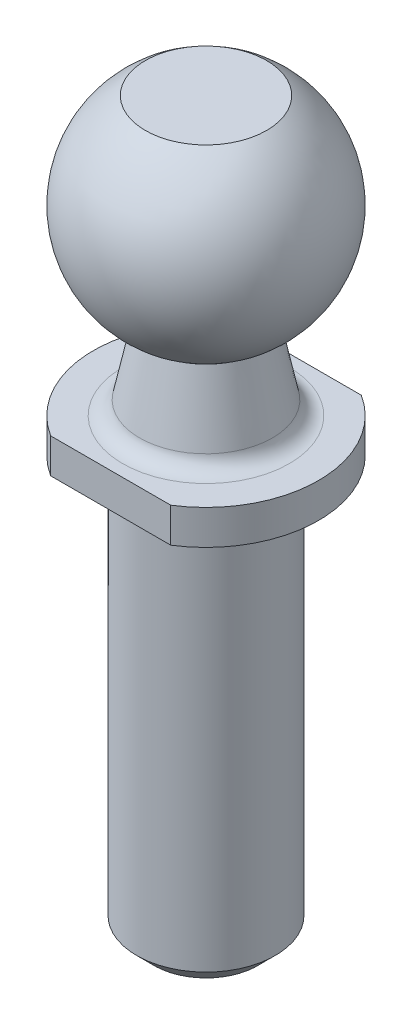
ISO-10303-21;
HEADER;
FILE_DESCRIPTION(('STEP AP214'),'2;1');
FILE_NAME('part.step','',(''),(''),'','','');
FILE_SCHEMA(('AUTOMOTIVE_DESIGN { 1 0 10303 214 1 1 1 1 }'));
ENDSEC;
DATA;
#1=APPLICATION_CONTEXT('core data for automotive mechanical design processes');
#2=APPLICATION_PROTOCOL_DEFINITION('international standard','automotive_design',2000,#1);
#3=PRODUCT_CONTEXT('',#1,'mechanical');
#4=PRODUCT('Part','Part','',(#3));
#5=PRODUCT_RELATED_PRODUCT_CATEGORY('part','',(#4));
#6=PRODUCT_DEFINITION_FORMATION('','',#4);
#7=PRODUCT_DEFINITION_CONTEXT('part definition',#1,'design');
#8=PRODUCT_DEFINITION('design','',#6,#7);
#9=PRODUCT_DEFINITION_SHAPE('','',#8);
#10=(LENGTH_UNIT() NAMED_UNIT(*) SI_UNIT(.MILLI.,.METRE.));
#11=(NAMED_UNIT(*) PLANE_ANGLE_UNIT() SI_UNIT($,.RADIAN.));
#12=(NAMED_UNIT(*) SI_UNIT($,.STERADIAN.) SOLID_ANGLE_UNIT());
#13=UNCERTAINTY_MEASURE_WITH_UNIT(LENGTH_MEASURE(1.E-05),#10,'distance_accuracy_value','');
#14=(GEOMETRIC_REPRESENTATION_CONTEXT(3) GLOBAL_UNCERTAINTY_ASSIGNED_CONTEXT((#13)) GLOBAL_UNIT_ASSIGNED_CONTEXT((#10,
#11,#12)) REPRESENTATION_CONTEXT('',''));
#15=CARTESIAN_POINT('',(0.,0.,0.));
#16=DIRECTION('',(0.,0.,1.));
#17=DIRECTION('',(1.,0.,0.));
#18=AXIS2_PLACEMENT_3D('',#15,#16,#17);
#19=CARTESIAN_POINT('',(-1.38777878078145E-13,12.5227744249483,1.38777878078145E-13));
#20=DIRECTION('',(0.,1.,0.));
#21=DIRECTION('',(-1.,0.,0.));
#22=AXIS2_PLACEMENT_3D('',#19,#20,#21);
#23=CYLINDRICAL_SURFACE('',#22,6.49999999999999);
#24=DIRECTION('',(0.,1.,0.));
#25=VECTOR('',#24,1.);
#26=CARTESIAN_POINT('',(3.46410161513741,12.5227744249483,5.50000000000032));
#27=LINE('',#26,#25);
#28=CARTESIAN_POINT('',(3.46410161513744,0.,5.50000000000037));
#29=VERTEX_POINT('',#28);
#30=CARTESIAN_POINT('',(3.46410161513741,1.99999999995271,5.50000000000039));
#31=VERTEX_POINT('',#30);
#32=EDGE_CURVE('E113',#29,#31,#27,.T.);
#33=ORIENTED_EDGE('',*,*,#32,.F.);
#34=CARTESIAN_POINT('',(0.,0.,0.));
#35=DIRECTION('',(0.,1.,0.));
#36=DIRECTION('',(-1.,0.,0.));
#37=AXIS2_PLACEMENT_3D('',#34,#35,#36);
#38=CIRCLE('',#37,6.49999999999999);
#39=CARTESIAN_POINT('',(3.46410161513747,0.,-5.49999999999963));
#40=VERTEX_POINT('',#39);
#41=EDGE_CURVE('E84',#29,#40,#38,.T.);
#42=ORIENTED_EDGE('',*,*,#41,.T.);
#43=DIRECTION('',(0.,1.,0.));
#44=VECTOR('',#43,1.);
#45=CARTESIAN_POINT('',(3.46410161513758,12.5227744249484,-5.49999999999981));
#46=LINE('',#45,#44);
#47=CARTESIAN_POINT('',(3.46410161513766,1.99999999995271,-5.49999999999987));
#48=VERTEX_POINT('',#47);
#49=EDGE_CURVE('E45',#48,#40,#46,.F.);
#50=ORIENTED_EDGE('',*,*,#49,.F.);
#51=CARTESIAN_POINT('',(0.,2.,0.));
#52=DIRECTION('',(0.,1.,0.));
#53=DIRECTION('',(-1.,0.,0.));
#54=AXIS2_PLACEMENT_3D('',#51,#52,#53);
#55=CIRCLE('',#54,6.49999999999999);
#56=EDGE_CURVE('E82',#31,#48,#55,.T.);
#57=ORIENTED_EDGE('',*,*,#56,.F.);
#58=EDGE_LOOP('',(#33,#42,#50,#57));
#59=FACE_BOUND('',#58,.T.);
#60=ADVANCED_FACE('F31',(#59),#23,.T.);
#61=DIRECTION('',(0.,1.,0.));
#62=VECTOR('',#61,1.);
#63=CARTESIAN_POINT('',(-3.46410161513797,12.5227744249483,5.50000000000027));
#64=LINE('',#63,#62);
#65=CARTESIAN_POINT('',(-3.46410161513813,1.99999999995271,5.50000000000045));
#66=VERTEX_POINT('',#65);
#67=CARTESIAN_POINT('',(-3.46410161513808,0.,5.50000000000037));
#68=VERTEX_POINT('',#67);
#69=EDGE_CURVE('E52',#66,#68,#64,.F.);
#70=ORIENTED_EDGE('',*,*,#69,.F.);
#71=CARTESIAN_POINT('',(-3.46410161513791,1.99999999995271,-5.49999999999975));
#72=VERTEX_POINT('',#71);
#73=EDGE_CURVE('E89',#72,#66,#55,.T.);
#74=ORIENTED_EDGE('',*,*,#73,.F.);
#75=DIRECTION('',(0.,1.,0.));
#76=VECTOR('',#75,1.);
#77=CARTESIAN_POINT('',(-3.46410161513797,12.5227744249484,-5.4999999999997));
#78=LINE('',#77,#76);
#79=CARTESIAN_POINT('',(-3.46410161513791,0.,-5.49999999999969));
#80=VERTEX_POINT('',#79);
#81=EDGE_CURVE('E71',#80,#72,#78,.T.);
#82=ORIENTED_EDGE('',*,*,#81,.F.);
#83=EDGE_CURVE('E110',#80,#68,#38,.T.);
#84=ORIENTED_EDGE('',*,*,#83,.T.);
#85=EDGE_LOOP('',(#70,#74,#82,#84));
#86=FACE_BOUND('',#85,.T.);
#87=ADVANCED_FACE('F109',(#86),#23,.T.);
#88=CARTESIAN_POINT('',(6.4999999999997,2.,3.60822483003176E-13));
#89=DIRECTION('',(0.,-1.,0.));
#90=DIRECTION('',(1.,0.,0.));
#91=AXIS2_PLACEMENT_3D('',#88,#89,#90);
#92=PLANE('',#91);
#93=CARTESIAN_POINT('',(0.,2.,0.));
#94=DIRECTION('',(0.,-1.,0.));
#95=DIRECTION('',(1.,0.,0.));
#96=AXIS2_PLACEMENT_3D('',#93,#94,#95);
#97=CIRCLE('',#96,4.81162232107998);
#98=CARTESIAN_POINT('',(4.81162232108,2.,0.));
#99=VERTEX_POINT('',#98);
#100=EDGE_CURVE('E92',#99,#99,#97,.T.);
#101=ORIENTED_EDGE('',*,*,#100,.T.);
#102=EDGE_LOOP('',(#101));
#103=FACE_BOUND('',#102,.T.);
#104=DIRECTION('',(1.,0.,0.));
#105=VECTOR('',#104,1.);
#106=CARTESIAN_POINT('',(7.07631874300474,1.9999999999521,5.50000000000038));
#107=LINE('',#106,#105);
#108=EDGE_CURVE('E76',#66,#31,#107,.T.);
#109=ORIENTED_EDGE('',*,*,#108,.T.);
#110=ORIENTED_EDGE('',*,*,#56,.T.);
#111=DIRECTION('',(-1.,0.,0.));
#112=VECTOR('',#111,1.);
#113=CARTESIAN_POINT('',(7.07631874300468,1.99999999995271,-5.49999999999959));
#114=LINE('',#113,#112);
#115=EDGE_CURVE('E68',#48,#72,#114,.T.);
#116=ORIENTED_EDGE('',*,*,#115,.T.);
#117=ORIENTED_EDGE('',*,*,#73,.T.);
#118=EDGE_LOOP('',(#109,#110,#116,#117));
#119=FACE_BOUND('',#118,.T.);
#120=ADVANCED_FACE('F87',(#103,#119),#92,.F.);
#121=CARTESIAN_POINT('',(3.99999999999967,0.,2.22044604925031E-13));
#122=DIRECTION('',(0.,1.,0.));
#123=DIRECTION('',(-1.,0.,0.));
#124=AXIS2_PLACEMENT_3D('',#121,#122,#123);
#125=PLANE('',#124);
#126=CARTESIAN_POINT('',(0.,0.,0.));
#127=DIRECTION('',(0.,1.,0.));
#128=DIRECTION('',(-1.,0.,0.));
#129=AXIS2_PLACEMENT_3D('',#126,#127,#128);
#130=CIRCLE('',#129,4.);
#131=CARTESIAN_POINT('',(-4.00000000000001,0.,0.));
#132=VERTEX_POINT('',#131);
#133=EDGE_CURVE('E115',#132,#132,#130,.T.);
#134=ORIENTED_EDGE('',*,*,#133,.T.);
#135=EDGE_LOOP('',(#134));
#136=FACE_BOUND('',#135,.T.);
#137=DIRECTION('',(1.,0.,0.));
#138=VECTOR('',#137,1.);
#139=CARTESIAN_POINT('',(3.99999999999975,0.,5.50000000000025));
#140=LINE('',#139,#138);
#141=EDGE_CURVE('E11',#68,#29,#140,.T.);
#142=ORIENTED_EDGE('',*,*,#141,.F.);
#143=ORIENTED_EDGE('',*,*,#83,.F.);
#144=DIRECTION('',(-1.,0.,0.));
#145=VECTOR('',#144,1.);
#146=CARTESIAN_POINT('',(3.99999999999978,0.,-5.49999999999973));
#147=LINE('',#146,#145);
#148=EDGE_CURVE('E38',#40,#80,#147,.T.);
#149=ORIENTED_EDGE('',*,*,#148,.F.);
#150=ORIENTED_EDGE('',*,*,#41,.F.);
#151=EDGE_LOOP('',(#142,#143,#149,#150));
#152=FACE_BOUND('',#151,.T.);
#153=ADVANCED_FACE('F112',(#136,#152),#125,.F.);
#154=CARTESIAN_POINT('',(0.,2.,0.));
#155=DIRECTION('',(0.,-1.,0.));
#156=DIRECTION('',(1.,0.,0.));
#157=AXIS2_PLACEMENT_3D('',#154,#155,#156);
#158=CONICAL_SURFACE('',#157,4.,0.207221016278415);
#159=CARTESIAN_POINT('',(0.,2.79425883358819,0.));
#160=DIRECTION('',(0.,-1.,0.));
#161=DIRECTION('',(1.,0.,0.));
#162=AXIS2_PLACEMENT_3D('',#159,#160,#161);
#163=CIRCLE('',#162,3.83301587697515);
#164=CARTESIAN_POINT('',(3.83301587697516,2.79425883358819,0.));
#165=VERTEX_POINT('',#164);
#166=EDGE_CURVE('E88',#165,#165,#163,.F.);
#167=ORIENTED_EDGE('',*,*,#166,.T.);
#168=EDGE_LOOP('',(#167));
#169=FACE_BOUND('',#168,.T.);
#170=CARTESIAN_POINT('',(-5.27355936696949E-13,6.75649312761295,-1.11022302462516E-13));
#171=DIRECTION('',(0.,1.,0.));
#172=DIRECTION('',(-1.,0.,0.));
#173=AXIS2_PLACEMENT_3D('',#170,#171,#172);
#174=CIRCLE('',#173,2.99999999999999);
#175=CARTESIAN_POINT('',(2.99999999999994,6.75649312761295,1.38777878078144E-13));
#176=VERTEX_POINT('',#175);
#177=EDGE_CURVE('E94',#176,#176,#174,.T.);
#178=ORIENTED_EDGE('',*,*,#177,.F.);
#179=EDGE_LOOP('',(#178));
#180=FACE_BOUND('',#179,.T.);
#181=ADVANCED_FACE('F129',(#169,#180),#158,.T.);
#182=CARTESIAN_POINT('',(-1.38777878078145E-13,12.5227744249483,1.38777878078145E-13));
#183=DIRECTION('',(0.,1.,0.));
#184=DIRECTION('',(1.,0.,0.));
#185=AXIS2_PLACEMENT_3D('',#182,#183,#184);
#186=SPHERICAL_SURFACE('',#185,6.5);
#187=CARTESIAN_POINT('',(-4.9960036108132E-13,18.,1.38777878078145E-13));
#188=DIRECTION('',(0.,1.,0.));
#189=DIRECTION('',(-1.,0.,0.));
#190=AXIS2_PLACEMENT_3D('',#187,#188,#189);
#191=CIRCLE('',#190,3.49999999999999);
#192=CARTESIAN_POINT('',(3.4999999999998,18.,1.38777878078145E-13));
#193=VERTEX_POINT('',#192);
#194=EDGE_CURVE('E120',#193,#193,#191,.T.);
#195=CARTESIAN_POINT('',(3.4999999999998,18.,1.38777878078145E-13));
#196=CARTESIAN_POINT('',(3.61943361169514,17.9236892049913,1.38777878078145E-13));
#197=CARTESIAN_POINT('',(3.73636293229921,17.8434608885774,1.38777878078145E-13));
#198=CARTESIAN_POINT('',(3.96473134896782,17.6755375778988,1.38777878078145E-13));
#199=CARTESIAN_POINT('',(4.07617044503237,17.587842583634,1.38777878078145E-13));
#200=CARTESIAN_POINT('',(4.293076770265,17.4053542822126,1.38777878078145E-13));
#201=CARTESIAN_POINT('',(4.39854399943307,17.3105609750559,1.38777878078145E-13));
#202=CARTESIAN_POINT('',(4.60305678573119,17.1142833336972,1.38777878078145E-13));
#203=CARTESIAN_POINT('',(4.70210234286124,17.0127989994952,1.38777878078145E-13));
#204=CARTESIAN_POINT('',(4.89334776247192,16.8035729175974,1.38777878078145E-13));
#205=CARTESIAN_POINT('',(4.98554762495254,16.6958311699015,1.38777878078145E-13));
#206=CARTESIAN_POINT('',(5.16270736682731,16.4745512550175,1.38777878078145E-13));
#207=CARTESIAN_POINT('',(5.24766724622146,16.3610130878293,1.38777878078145E-13));
#208=CARTESIAN_POINT('',(5.40998358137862,16.1286259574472,1.38777878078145E-13));
#209=CARTESIAN_POINT('',(5.48734003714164,16.0097769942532,1.38777878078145E-13));
#210=CARTESIAN_POINT('',(5.63411864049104,15.7672766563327,1.38777878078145E-13));
#211=CARTESIAN_POINT('',(5.70354078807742,15.6436252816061,1.38777878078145E-13));
#212=CARTESIAN_POINT('',(5.83415382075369,15.3920490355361,1.38777878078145E-13));
#213=CARTESIAN_POINT('',(5.89534470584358,15.2641241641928,1.38777878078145E-13));
#214=CARTESIAN_POINT('',(6.00923347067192,15.0045481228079,1.38777878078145E-13));
#215=CARTESIAN_POINT('',(6.06193135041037,14.8728969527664,1.38777878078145E-13));
#216=CARTESIAN_POINT('',(6.15860868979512,14.6064314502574,1.38777878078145E-13));
#217=CARTESIAN_POINT('',(6.20258814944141,14.47161711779,1.38777878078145E-13));
#218=CARTESIAN_POINT('',(6.28164052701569,14.1994019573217,1.38777878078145E-13));
#219=CARTESIAN_POINT('',(6.31671344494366,14.0620011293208,1.38777878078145E-13));
#220=CARTESIAN_POINT('',(6.37780271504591,13.7852007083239,1.38777878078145E-13));
#221=CARTESIAN_POINT('',(6.40381906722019,13.6458011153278,1.38777878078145E-13));
#222=CARTESIAN_POINT('',(6.44668392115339,13.3655994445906,1.38777878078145E-13));
#223=CARTESIAN_POINT('',(6.46353242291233,13.2247973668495,1.38777878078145E-13));
#224=CARTESIAN_POINT('',(6.4879895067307,12.9423930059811,1.38777878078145E-13));
#225=CARTESIAN_POINT('',(6.49559808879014,12.8007907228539,1.38777878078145E-13));
#226=CARTESIAN_POINT('',(6.50154278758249,12.5173916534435,1.38777878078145E-13));
#227=CARTESIAN_POINT('',(6.4998789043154,12.3755948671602,1.38777878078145E-13));
#228=CARTESIAN_POINT('',(6.48728578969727,12.0924133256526,1.38777878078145E-13));
#229=CARTESIAN_POINT('',(6.47635655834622,11.9510285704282,1.38777878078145E-13));
#230=CARTESIAN_POINT('',(6.44527949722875,11.6692758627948,1.38777878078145E-13));
#231=CARTESIAN_POINT('',(6.42513166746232,11.5289079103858,1.38777878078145E-13));
#232=CARTESIAN_POINT('',(6.37570359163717,11.249789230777,1.38777878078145E-13));
#233=CARTESIAN_POINT('',(6.34642334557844,11.1110385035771,1.38777878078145E-13));
#234=CARTESIAN_POINT('',(6.27885568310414,10.8357477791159,1.38777878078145E-13));
#235=CARTESIAN_POINT('',(6.24056826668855,10.6992077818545,1.38777878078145E-13));
#236=CARTESIAN_POINT('',(6.15515003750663,10.4289225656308,1.38777878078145E-13));
#237=CARTESIAN_POINT('',(6.1080192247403,10.2951773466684,1.38777878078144E-13));
#238=CARTESIAN_POINT('',(6.00511580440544,10.0310537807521,1.38777878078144E-13));
#239=CARTESIAN_POINT('',(5.94934319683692,9.90067543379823,1.38777878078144E-13));
#240=CARTESIAN_POINT('',(5.82939475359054,9.64384330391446,1.38777878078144E-13));
#241=CARTESIAN_POINT('',(5.76521891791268,9.51738952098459,1.38777878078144E-13));
#242=CARTESIAN_POINT('',(5.62873853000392,9.26894742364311,1.38777878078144E-13));
#243=CARTESIAN_POINT('',(5.55643397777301,9.14695910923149,1.38777878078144E-13));
#244=CARTESIAN_POINT('',(5.40400543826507,8.90796975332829,1.38777878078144E-13));
#245=CARTESIAN_POINT('',(5.32388145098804,8.7909687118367,1.38777878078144E-13));
#246=CARTESIAN_POINT('',(5.15615677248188,8.56245436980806,1.38777878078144E-13));
#247=CARTESIAN_POINT('',(5.06855608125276,8.450941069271,1.38777878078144E-13));
#248=CARTESIAN_POINT('',(4.88625269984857,8.23387921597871,1.38777878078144E-13));
#249=CARTESIAN_POINT('',(4.7915500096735,8.12833066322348,1.38777878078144E-13));
#250=CARTESIAN_POINT('',(4.59544774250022,7.92364975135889,1.38777878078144E-13));
#251=CARTESIAN_POINT('',(4.49404816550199,7.82451739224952,1.38777878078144E-13));
#252=CARTESIAN_POINT('',(4.28498577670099,7.63309304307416,1.38777878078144E-13));
#253=CARTESIAN_POINT('',(4.17732296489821,7.54080105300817,1.38777878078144E-13));
#254=CARTESIAN_POINT('',(3.95619494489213,7.3634517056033,1.38777878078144E-13));
#255=CARTESIAN_POINT('',(3.84272973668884,7.27839434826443,1.38777878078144E-13));
#256=CARTESIAN_POINT('',(3.61048110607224,7.11588001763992,1.38777878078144E-13));
#257=CARTESIAN_POINT('',(3.49169768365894,7.03842304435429,1.38777878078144E-13));
#258=CARTESIAN_POINT('',(3.24932506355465,6.89143363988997,1.38777878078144E-13));
#259=CARTESIAN_POINT('',(3.12573586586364,6.82190120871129,1.38777878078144E-13));
#260=CARTESIAN_POINT('',(2.99999999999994,6.75649312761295,1.38777878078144E-13));
#261=B_SPLINE_CURVE_WITH_KNOTS('',3,(#195,#196,#197,#198,#199,#200,#201,#202,#203,#204,#205,
#206,#207,#208,#209,#210,#211,#212,#213,#214,#215,#216,#217,#218,#219,#220,#221,#222,#223,#224,
#225,#226,#227,#228,#229,#230,#231,#232,#233,#234,#235,#236,#237,#238,#239,#240,#241,#242,#243,
#244,#245,#246,#247,#248,#249,#250,#251,#252,#253,#254,#255,#256,#257,#258,#259,#260),
.UNSPECIFIED.,.F.,.F.,(4,2,2,2,2,2,2,2,2,2,2,2,2,2,2,2,2,2,2,2,2,2,2,2,2,2,2,2,2,2,2,2,4),(0.,
0.425116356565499,0.850232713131,1.2753490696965,1.700465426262,2.1255817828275,
2.55069813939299,2.97581449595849,3.40093085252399,3.82604720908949,4.25116356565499,
4.67627992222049,5.10139627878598,5.52651263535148,5.95162899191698,6.37674534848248,
6.80186170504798,7.22697806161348,7.65209441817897,8.07721077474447,8.50232713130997,
8.92744348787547,9.35255984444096,9.77767620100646,10.202792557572,10.6279089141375,
11.053025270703,11.4781416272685,11.903257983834,12.3283743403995,12.753490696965,
13.1786070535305,13.603723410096),.UNSPECIFIED.);
#262=EDGE_CURVE('BSEAM127',#193,#176,#261,.T.);
#263=ORIENTED_EDGE('',*,*,#194,.F.);
#264=ORIENTED_EDGE('',*,*,#177,.T.);
#265=ORIENTED_EDGE('',*,*,#262,.T.);
#266=ORIENTED_EDGE('',*,*,#262,.F.);
#267=EDGE_LOOP('',(#263,#265,#264,#266));
#268=FACE_BOUND('',#267,.T.);
#269=ADVANCED_FACE('F127',(#268),#186,.T.);
#270=CARTESIAN_POINT('',(-4.9960036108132E-13,18.,1.38777878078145E-13));
#271=DIRECTION('',(0.,-1.,0.));
#272=DIRECTION('',(1.,0.,0.));
#273=AXIS2_PLACEMENT_3D('',#270,#271,#272);
#274=PLANE('',#273);
#275=ORIENTED_EDGE('',*,*,#194,.T.);
#276=EDGE_LOOP('',(#275));
#277=FACE_BOUND('',#276,.T.);
#278=ADVANCED_FACE('F137',(#277),#274,.F.);
#279=CARTESIAN_POINT('',(-1.11022302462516E-13,-24.,0.));
#280=DIRECTION('',(0.,1.,0.));
#281=DIRECTION('',(-1.,0.,0.));
#282=AXIS2_PLACEMENT_3D('',#279,#280,#281);
#283=PLANE('',#282);
#284=CARTESIAN_POINT('',(0.,-24.,0.));
#285=DIRECTION('',(0.,1.,0.));
#286=DIRECTION('',(-1.,0.,0.));
#287=AXIS2_PLACEMENT_3D('',#284,#285,#286);
#288=CIRCLE('',#287,2.99999999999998);
#289=CARTESIAN_POINT('',(-2.99999999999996,-24.,0.));
#290=VERTEX_POINT('',#289);
#291=EDGE_CURVE('E103',#290,#290,#288,.F.);
#292=ORIENTED_EDGE('',*,*,#291,.T.);
#293=EDGE_LOOP('',(#292));
#294=FACE_BOUND('',#293,.T.);
#295=ADVANCED_FACE('F167',(#294),#283,.F.);
#296=CARTESIAN_POINT('',(-1.38777878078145E-13,12.5227744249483,1.38777878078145E-13));
#297=DIRECTION('',(0.,1.,0.));
#298=DIRECTION('',(-1.,0.,0.));
#299=AXIS2_PLACEMENT_3D('',#296,#297,#298);
#300=CYLINDRICAL_SURFACE('',#299,3.99999999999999);
#301=CARTESIAN_POINT('',(0.,-23.,0.));
#302=DIRECTION('',(0.,1.,0.));
#303=DIRECTION('',(-1.,0.,0.));
#304=AXIS2_PLACEMENT_3D('',#301,#302,#303);
#305=CIRCLE('',#304,3.99999999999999);
#306=CARTESIAN_POINT('',(-3.99999999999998,-23.,0.));
#307=VERTEX_POINT('',#306);
#308=EDGE_CURVE('E100',#307,#307,#305,.T.);
#309=ORIENTED_EDGE('',*,*,#308,.T.);
#310=EDGE_LOOP('',(#309));
#311=FACE_BOUND('',#310,.T.);
#312=ORIENTED_EDGE('',*,*,#133,.F.);
#313=EDGE_LOOP('',(#312));
#314=FACE_BOUND('',#313,.T.);
#315=ADVANCED_FACE('F158',(#311,#314),#300,.T.);
#316=CARTESIAN_POINT('',(0.,3.,0.));
#317=DIRECTION('',(0.,-1.,0.));
#318=DIRECTION('',(1.,0.,0.));
#319=AXIS2_PLACEMENT_3D('',#316,#317,#318);
#320=TOROIDAL_SURFACE('',#319,4.81162232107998,1.);
#321=ORIENTED_EDGE('',*,*,#100,.F.);
#322=EDGE_LOOP('',(#321));
#323=FACE_BOUND('',#322,.T.);
#324=ORIENTED_EDGE('',*,*,#166,.F.);
#325=EDGE_LOOP('',(#324));
#326=FACE_BOUND('',#325,.T.);
#327=ADVANCED_FACE('F154',(#323,#326),#320,.F.);
#328=CARTESIAN_POINT('',(0.,-23.,0.));
#329=DIRECTION('',(0.,1.,0.));
#330=DIRECTION('',(-1.,0.,0.));
#331=AXIS2_PLACEMENT_3D('',#328,#329,#330);
#332=CONICAL_SURFACE('',#331,3.99999999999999,0.785398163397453);
#333=ORIENTED_EDGE('',*,*,#291,.F.);
#334=EDGE_LOOP('',(#333));
#335=FACE_BOUND('',#334,.T.);
#336=ORIENTED_EDGE('',*,*,#308,.F.);
#337=EDGE_LOOP('',(#336));
#338=FACE_BOUND('',#337,.T.);
#339=ADVANCED_FACE('F157',(#335,#338),#332,.T.);
#340=CARTESIAN_POINT('',(7.07631874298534,1000000.,-5.49999999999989));
#341=DIRECTION('',(0.,0.,-1.));
#342=DIRECTION('',(-1.,0.,0.));
#343=AXIS2_PLACEMENT_3D('',#340,#341,#342);
#344=PLANE('',#343);
#345=ORIENTED_EDGE('',*,*,#81,.T.);
#346=ORIENTED_EDGE('',*,*,#115,.F.);
#347=ORIENTED_EDGE('',*,*,#49,.T.);
#348=ORIENTED_EDGE('',*,*,#148,.T.);
#349=EDGE_LOOP('',(#345,#346,#347,#348));
#350=FACE_BOUND('',#349,.T.);
#351=ADVANCED_FACE('F69',(#350),#344,.T.);
#352=CARTESIAN_POINT('',(7.07631874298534,1000000.,5.50000000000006));
#353=DIRECTION('',(0.,0.,1.));
#354=DIRECTION('',(1.,0.,0.));
#355=AXIS2_PLACEMENT_3D('',#352,#353,#354);
#356=PLANE('',#355);
#357=ORIENTED_EDGE('',*,*,#32,.T.);
#358=ORIENTED_EDGE('',*,*,#108,.F.);
#359=ORIENTED_EDGE('',*,*,#69,.T.);
#360=ORIENTED_EDGE('',*,*,#141,.T.);
#361=EDGE_LOOP('',(#357,#358,#359,#360));
#362=FACE_BOUND('',#361,.T.);
#363=ADVANCED_FACE('F211',(#362),#356,.T.);
#364=CLOSED_SHELL('',(#60,#87,#120,#153,#181,#269,#278,#295,#315,#327,#339,#351,#363));
#365=MANIFOLD_SOLID_BREP('B2',#364);
#366=ADVANCED_BREP_SHAPE_REPRESENTATION('',(#18,#365),#14);
#367=SHAPE_DEFINITION_REPRESENTATION(#9,#366);
ENDSEC;
END-ISO-10303-21;
